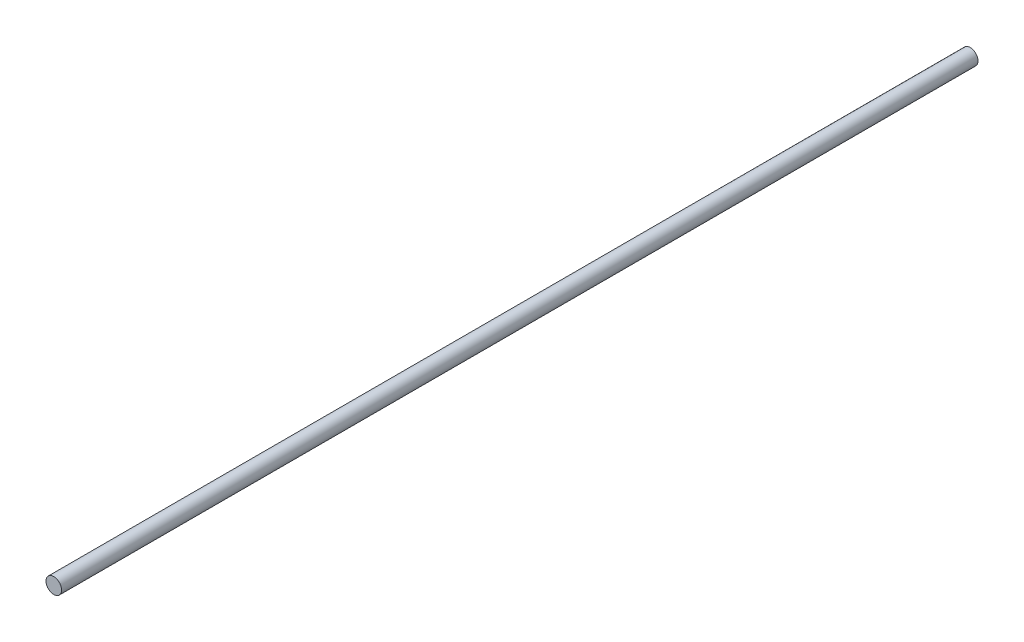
ISO-10303-21;
HEADER;
FILE_DESCRIPTION(('STEP AP214'),'2;1');
FILE_NAME('part.step','',(''),(''),'','','');
FILE_SCHEMA(('AUTOMOTIVE_DESIGN { 1 0 10303 214 1 1 1 1 }'));
ENDSEC;
DATA;
#1=APPLICATION_CONTEXT('core data for automotive mechanical design processes');
#2=APPLICATION_PROTOCOL_DEFINITION('international standard','automotive_design',2000,#1);
#3=PRODUCT_CONTEXT('',#1,'mechanical');
#4=PRODUCT('Part','Part','',(#3));
#5=PRODUCT_RELATED_PRODUCT_CATEGORY('part','',(#4));
#6=PRODUCT_DEFINITION_FORMATION('','',#4);
#7=PRODUCT_DEFINITION_CONTEXT('part definition',#1,'design');
#8=PRODUCT_DEFINITION('design','',#6,#7);
#9=PRODUCT_DEFINITION_SHAPE('','',#8);
#10=(LENGTH_UNIT() NAMED_UNIT(*) SI_UNIT(.MILLI.,.METRE.));
#11=(NAMED_UNIT(*) PLANE_ANGLE_UNIT() SI_UNIT($,.RADIAN.));
#12=(NAMED_UNIT(*) SI_UNIT($,.STERADIAN.) SOLID_ANGLE_UNIT());
#13=UNCERTAINTY_MEASURE_WITH_UNIT(LENGTH_MEASURE(1.E-05),#10,'distance_accuracy_value','');
#14=(GEOMETRIC_REPRESENTATION_CONTEXT(3) GLOBAL_UNCERTAINTY_ASSIGNED_CONTEXT((#13)) GLOBAL_UNIT_ASSIGNED_CONTEXT((#10,
#11,#12)) REPRESENTATION_CONTEXT('',''));
#15=CARTESIAN_POINT('',(0.,0.,0.));
#16=DIRECTION('',(0.,0.,1.));
#17=DIRECTION('',(1.,0.,0.));
#18=AXIS2_PLACEMENT_3D('',#15,#16,#17);
#19=CARTESIAN_POINT('',(0.,0.,1000.));
#20=DIRECTION('',(0.,0.,-1.));
#21=DIRECTION('',(-1.,0.,0.));
#22=AXIS2_PLACEMENT_3D('',#19,#20,#21);
#23=CYLINDRICAL_SURFACE('',#22,8.5);
#24=CARTESIAN_POINT('',(0.,0.,1000.));
#25=DIRECTION('',(0.,0.,1.));
#26=DIRECTION('',(1.,0.,0.));
#27=AXIS2_PLACEMENT_3D('',#24,#25,#26);
#28=CIRCLE('',#27,8.5);
#29=CARTESIAN_POINT('',(8.5,0.,1000.));
#30=VERTEX_POINT('',#29);
#31=EDGE_CURVE('E10',#30,#30,#28,.T.);
#32=ORIENTED_EDGE('',*,*,#31,.F.);
#33=EDGE_LOOP('',(#32));
#34=FACE_BOUND('',#33,.T.);
#35=CARTESIAN_POINT('',(0.,0.,0.));
#36=DIRECTION('',(0.,0.,1.));
#37=DIRECTION('',(1.,0.,0.));
#38=AXIS2_PLACEMENT_3D('',#35,#36,#37);
#39=CIRCLE('',#38,8.5);
#40=CARTESIAN_POINT('',(8.5,0.,0.));
#41=VERTEX_POINT('',#40);
#42=EDGE_CURVE('E43',#41,#41,#39,.T.);
#43=ORIENTED_EDGE('',*,*,#42,.T.);
#44=EDGE_LOOP('',(#43));
#45=FACE_BOUND('',#44,.T.);
#46=ADVANCED_FACE('F40',(#34,#45),#23,.T.);
#47=CARTESIAN_POINT('',(0.,0.,1000.));
#48=DIRECTION('',(0.,0.,1.));
#49=DIRECTION('',(1.,0.,0.));
#50=AXIS2_PLACEMENT_3D('',#47,#48,#49);
#51=PLANE('',#50);
#52=ORIENTED_EDGE('',*,*,#31,.T.);
#53=EDGE_LOOP('',(#52));
#54=FACE_BOUND('',#53,.T.);
#55=ADVANCED_FACE('F55',(#54),#51,.T.);
#56=CARTESIAN_POINT('',(0.,0.,0.));
#57=DIRECTION('',(0.,0.,1.));
#58=DIRECTION('',(1.,0.,0.));
#59=AXIS2_PLACEMENT_3D('',#56,#57,#58);
#60=PLANE('',#59);
#61=ORIENTED_EDGE('',*,*,#42,.F.);
#62=EDGE_LOOP('',(#61));
#63=FACE_BOUND('',#62,.T.);
#64=ADVANCED_FACE('F53',(#63),#60,.F.);
#65=CLOSED_SHELL('',(#46,#55,#64));
#66=MANIFOLD_SOLID_BREP('B2',#65);
#67=ADVANCED_BREP_SHAPE_REPRESENTATION('',(#18,#66),#14);
#68=SHAPE_DEFINITION_REPRESENTATION(#9,#67);
ENDSEC;
END-ISO-10303-21;
